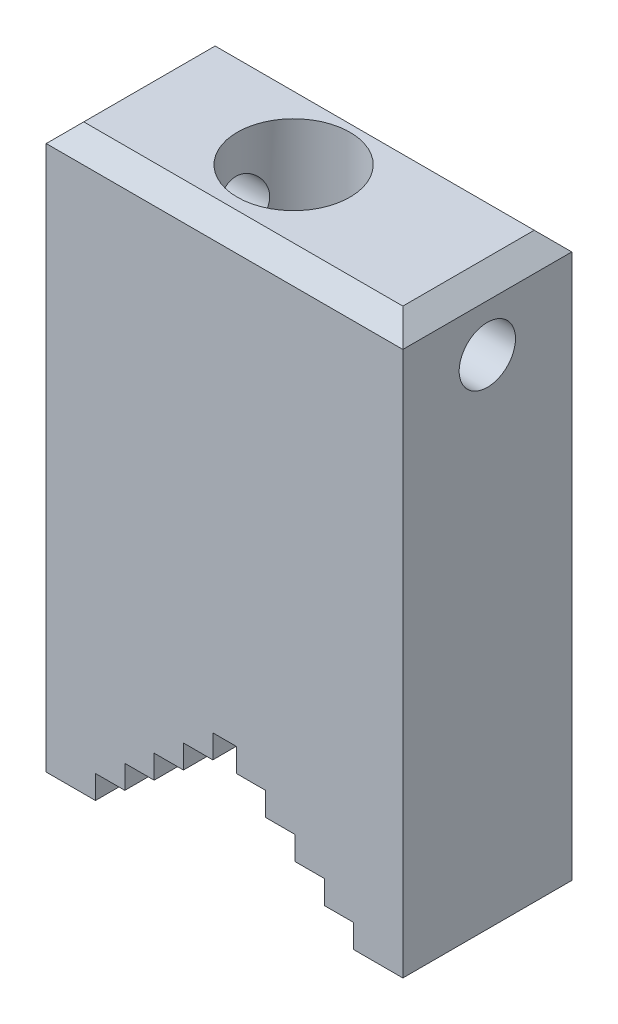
ISO-10303-21;
HEADER;
FILE_DESCRIPTION(('STEP AP214'),'2;1');
FILE_NAME('part.step','',(''),(''),'','','');
FILE_SCHEMA(('AUTOMOTIVE_DESIGN { 1 0 10303 214 1 1 1 1 }'));
ENDSEC;
DATA;
#1=APPLICATION_CONTEXT('core data for automotive mechanical design processes');
#2=APPLICATION_PROTOCOL_DEFINITION('international standard','automotive_design',2000,#1);
#3=PRODUCT_CONTEXT('',#1,'mechanical');
#4=PRODUCT('Part','Part','',(#3));
#5=PRODUCT_RELATED_PRODUCT_CATEGORY('part','',(#4));
#6=PRODUCT_DEFINITION_FORMATION('','',#4);
#7=PRODUCT_DEFINITION_CONTEXT('part definition',#1,'design');
#8=PRODUCT_DEFINITION('design','',#6,#7);
#9=PRODUCT_DEFINITION_SHAPE('','',#8);
#10=(LENGTH_UNIT() NAMED_UNIT(*) SI_UNIT(.MILLI.,.METRE.));
#11=(NAMED_UNIT(*) PLANE_ANGLE_UNIT() SI_UNIT($,.RADIAN.));
#12=(NAMED_UNIT(*) SI_UNIT($,.STERADIAN.) SOLID_ANGLE_UNIT());
#13=UNCERTAINTY_MEASURE_WITH_UNIT(LENGTH_MEASURE(1.E-05),#10,'distance_accuracy_value','');
#14=(GEOMETRIC_REPRESENTATION_CONTEXT(3) GLOBAL_UNCERTAINTY_ASSIGNED_CONTEXT((#13)) GLOBAL_UNIT_ASSIGNED_CONTEXT((#10,
#11,#12)) REPRESENTATION_CONTEXT('',''));
#15=CARTESIAN_POINT('',(0.,0.,0.));
#16=DIRECTION('',(0.,0.,1.));
#17=DIRECTION('',(1.,0.,0.));
#18=AXIS2_PLACEMENT_3D('',#15,#16,#17);
#19=CARTESIAN_POINT('',(-19.,0.,9.));
#20=DIRECTION('',(1.,0.,0.));
#21=DIRECTION('',(0.,0.,-1.));
#22=AXIS2_PLACEMENT_3D('',#19,#20,#21);
#23=PLANE('',#22);
#24=CARTESIAN_POINT('',(-19.,53.,0.));
#25=DIRECTION('',(1.,0.,0.));
#26=DIRECTION('',(0.,0.,-1.));
#27=AXIS2_PLACEMENT_3D('',#24,#25,#26);
#28=CIRCLE('',#27,3.);
#29=CARTESIAN_POINT('',(-19.,53.,-3.));
#30=VERTEX_POINT('',#29);
#31=EDGE_CURVE('E412',#30,#30,#28,.T.);
#32=ORIENTED_EDGE('',*,*,#31,.T.);
#33=EDGE_LOOP('',(#32));
#34=FACE_BOUND('',#33,.T.);
#35=DIRECTION('',(0.,-1.,0.));
#36=VECTOR('',#35,1.);
#37=CARTESIAN_POINT('',(-19.,0.,9.));
#38=LINE('',#37,#36);
#39=CARTESIAN_POINT('',(-19.,58.,9.));
#40=VERTEX_POINT('',#39);
#41=CARTESIAN_POINT('',(-19.,0.,9.));
#42=VERTEX_POINT('',#41);
#43=EDGE_CURVE('E229',#40,#42,#38,.T.);
#44=ORIENTED_EDGE('',*,*,#43,.F.);
#45=DIRECTION('',(0.,0.,-1.));
#46=VECTOR('',#45,1.);
#47=CARTESIAN_POINT('',(-19.,58.,9.));
#48=LINE('',#47,#46);
#49=CARTESIAN_POINT('',(-19.,58.,-9.));
#50=VERTEX_POINT('',#49);
#51=EDGE_CURVE('E400',#40,#50,#48,.T.);
#52=ORIENTED_EDGE('',*,*,#51,.T.);
#53=DIRECTION('',(0.,-1.,0.));
#54=VECTOR('',#53,1.);
#55=CARTESIAN_POINT('',(-19.,0.,-9.));
#56=LINE('',#55,#54);
#57=CARTESIAN_POINT('',(-19.,0.,-9.));
#58=VERTEX_POINT('',#57);
#59=EDGE_CURVE('E277',#50,#58,#56,.T.);
#60=ORIENTED_EDGE('',*,*,#59,.T.);
#61=DIRECTION('',(0.,0.,-1.));
#62=VECTOR('',#61,1.);
#63=CARTESIAN_POINT('',(-19.,0.,9.));
#64=LINE('',#63,#62);
#65=EDGE_CURVE('E385',#42,#58,#64,.T.);
#66=ORIENTED_EDGE('',*,*,#65,.F.);
#67=EDGE_LOOP('',(#44,#52,#60,#66));
#68=FACE_BOUND('',#67,.T.);
#69=ADVANCED_FACE('F31',(#34,#68),#23,.F.);
#70=CARTESIAN_POINT('',(-19.,0.,9.));
#71=DIRECTION('',(0.,1.,0.));
#72=DIRECTION('',(-1.,0.,0.));
#73=AXIS2_PLACEMENT_3D('',#70,#71,#72);
#74=PLANE('',#73);
#75=DIRECTION('',(1.,0.,0.));
#76=VECTOR('',#75,1.);
#77=CARTESIAN_POINT('',(-19.,0.,-9.));
#78=LINE('',#77,#76);
#79=CARTESIAN_POINT('',(-13.75,0.,-9.));
#80=VERTEX_POINT('',#79);
#81=EDGE_CURVE('E279',#58,#80,#78,.T.);
#82=ORIENTED_EDGE('',*,*,#81,.T.);
#83=DIRECTION('',(0.,0.,-1.));
#84=VECTOR('',#83,1.);
#85=CARTESIAN_POINT('',(-13.75,0.,9.));
#86=LINE('',#85,#84);
#87=CARTESIAN_POINT('',(-13.75,0.,9.));
#88=VERTEX_POINT('',#87);
#89=EDGE_CURVE('E382',#88,#80,#86,.T.);
#90=ORIENTED_EDGE('',*,*,#89,.F.);
#91=DIRECTION('',(1.,0.,0.));
#92=VECTOR('',#91,1.);
#93=CARTESIAN_POINT('',(-19.,0.,9.));
#94=LINE('',#93,#92);
#95=EDGE_CURVE('E231',#42,#88,#94,.T.);
#96=ORIENTED_EDGE('',*,*,#95,.F.);
#97=ORIENTED_EDGE('',*,*,#65,.T.);
#98=EDGE_LOOP('',(#82,#90,#96,#97));
#99=FACE_BOUND('',#98,.T.);
#100=ADVANCED_FACE('F427',(#99),#74,.F.);
#101=CARTESIAN_POINT('',(-13.75,0.,9.));
#102=DIRECTION('',(-1.,0.,0.));
#103=DIRECTION('',(0.,0.,1.));
#104=AXIS2_PLACEMENT_3D('',#101,#102,#103);
#105=PLANE('',#104);
#106=DIRECTION('',(0.,1.,0.));
#107=VECTOR('',#106,1.);
#108=CARTESIAN_POINT('',(-13.75,0.,-9.));
#109=LINE('',#108,#107);
#110=CARTESIAN_POINT('',(-13.75,2.5,-9.));
#111=VERTEX_POINT('',#110);
#112=EDGE_CURVE('E282',#80,#111,#109,.T.);
#113=ORIENTED_EDGE('',*,*,#112,.T.);
#114=DIRECTION('',(0.,0.,-1.));
#115=VECTOR('',#114,1.);
#116=CARTESIAN_POINT('',(-13.75,2.5,9.));
#117=LINE('',#116,#115);
#118=CARTESIAN_POINT('',(-13.75,2.5,9.));
#119=VERTEX_POINT('',#118);
#120=EDGE_CURVE('E379',#119,#111,#117,.T.);
#121=ORIENTED_EDGE('',*,*,#120,.F.);
#122=DIRECTION('',(0.,1.,0.));
#123=VECTOR('',#122,1.);
#124=CARTESIAN_POINT('',(-13.75,0.,9.));
#125=LINE('',#124,#123);
#126=EDGE_CURVE('E234',#88,#119,#125,.T.);
#127=ORIENTED_EDGE('',*,*,#126,.F.);
#128=ORIENTED_EDGE('',*,*,#89,.T.);
#129=EDGE_LOOP('',(#113,#121,#127,#128));
#130=FACE_BOUND('',#129,.T.);
#131=ADVANCED_FACE('F433',(#130),#105,.F.);
#132=CARTESIAN_POINT('',(-13.75,2.5,9.));
#133=DIRECTION('',(0.,1.,0.));
#134=DIRECTION('',(0.,0.,1.));
#135=AXIS2_PLACEMENT_3D('',#132,#133,#134);
#136=PLANE('',#135);
#137=DIRECTION('',(1.,0.,0.));
#138=VECTOR('',#137,1.);
#139=CARTESIAN_POINT('',(-13.75,2.5,-9.));
#140=LINE('',#139,#138);
#141=CARTESIAN_POINT('',(-10.625,2.5,-9.));
#142=VERTEX_POINT('',#141);
#143=EDGE_CURVE('E284',#111,#142,#140,.T.);
#144=ORIENTED_EDGE('',*,*,#143,.T.);
#145=DIRECTION('',(0.,0.,-1.));
#146=VECTOR('',#145,1.);
#147=CARTESIAN_POINT('',(-10.625,2.5,9.));
#148=LINE('',#147,#146);
#149=CARTESIAN_POINT('',(-10.625,2.5,9.));
#150=VERTEX_POINT('',#149);
#151=EDGE_CURVE('E376',#150,#142,#148,.T.);
#152=ORIENTED_EDGE('',*,*,#151,.F.);
#153=DIRECTION('',(1.,0.,0.));
#154=VECTOR('',#153,1.);
#155=CARTESIAN_POINT('',(-13.75,2.5,9.));
#156=LINE('',#155,#154);
#157=EDGE_CURVE('E236',#119,#150,#156,.T.);
#158=ORIENTED_EDGE('',*,*,#157,.F.);
#159=ORIENTED_EDGE('',*,*,#120,.T.);
#160=EDGE_LOOP('',(#144,#152,#158,#159));
#161=FACE_BOUND('',#160,.T.);
#162=ADVANCED_FACE('F558',(#161),#136,.F.);
#163=CARTESIAN_POINT('',(-10.625,2.5,9.));
#164=DIRECTION('',(-1.,0.,0.));
#165=DIRECTION('',(0.,0.,1.));
#166=AXIS2_PLACEMENT_3D('',#163,#164,#165);
#167=PLANE('',#166);
#168=DIRECTION('',(0.,1.,0.));
#169=VECTOR('',#168,1.);
#170=CARTESIAN_POINT('',(-10.625,2.5,-9.));
#171=LINE('',#170,#169);
#172=CARTESIAN_POINT('',(-10.625,5.,-9.));
#173=VERTEX_POINT('',#172);
#174=EDGE_CURVE('E286',#142,#173,#171,.T.);
#175=ORIENTED_EDGE('',*,*,#174,.T.);
#176=DIRECTION('',(0.,0.,-1.));
#177=VECTOR('',#176,1.);
#178=CARTESIAN_POINT('',(-10.625,5.,9.));
#179=LINE('',#178,#177);
#180=CARTESIAN_POINT('',(-10.625,5.,9.));
#181=VERTEX_POINT('',#180);
#182=EDGE_CURVE('E373',#181,#173,#179,.T.);
#183=ORIENTED_EDGE('',*,*,#182,.F.);
#184=DIRECTION('',(0.,1.,0.));
#185=VECTOR('',#184,1.);
#186=CARTESIAN_POINT('',(-10.625,2.5,9.));
#187=LINE('',#186,#185);
#188=EDGE_CURVE('E238',#150,#181,#187,.T.);
#189=ORIENTED_EDGE('',*,*,#188,.F.);
#190=ORIENTED_EDGE('',*,*,#151,.T.);
#191=EDGE_LOOP('',(#175,#183,#189,#190));
#192=FACE_BOUND('',#191,.T.);
#193=ADVANCED_FACE('F554',(#192),#167,.F.);
#194=CARTESIAN_POINT('',(-10.625,5.,9.));
#195=DIRECTION('',(0.,1.,0.));
#196=DIRECTION('',(0.,0.,1.));
#197=AXIS2_PLACEMENT_3D('',#194,#195,#196);
#198=PLANE('',#197);
#199=DIRECTION('',(1.,0.,0.));
#200=VECTOR('',#199,1.);
#201=CARTESIAN_POINT('',(-10.625,5.,-9.));
#202=LINE('',#201,#200);
#203=CARTESIAN_POINT('',(-7.5,5.,-9.));
#204=VERTEX_POINT('',#203);
#205=EDGE_CURVE('E288',#173,#204,#202,.T.);
#206=ORIENTED_EDGE('',*,*,#205,.T.);
#207=DIRECTION('',(0.,0.,-1.));
#208=VECTOR('',#207,1.);
#209=CARTESIAN_POINT('',(-7.5,5.,9.));
#210=LINE('',#209,#208);
#211=CARTESIAN_POINT('',(-7.5,5.,9.));
#212=VERTEX_POINT('',#211);
#213=EDGE_CURVE('E370',#212,#204,#210,.T.);
#214=ORIENTED_EDGE('',*,*,#213,.F.);
#215=DIRECTION('',(1.,0.,0.));
#216=VECTOR('',#215,1.);
#217=CARTESIAN_POINT('',(-10.625,5.,9.));
#218=LINE('',#217,#216);
#219=EDGE_CURVE('E240',#181,#212,#218,.T.);
#220=ORIENTED_EDGE('',*,*,#219,.F.);
#221=ORIENTED_EDGE('',*,*,#182,.T.);
#222=EDGE_LOOP('',(#206,#214,#220,#221));
#223=FACE_BOUND('',#222,.T.);
#224=ADVANCED_FACE('F550',(#223),#198,.F.);
#225=CARTESIAN_POINT('',(-7.5,5.,9.));
#226=DIRECTION('',(-1.,0.,0.));
#227=DIRECTION('',(0.,0.,1.));
#228=AXIS2_PLACEMENT_3D('',#225,#226,#227);
#229=PLANE('',#228);
#230=DIRECTION('',(0.,1.,0.));
#231=VECTOR('',#230,1.);
#232=CARTESIAN_POINT('',(-7.5,5.,-9.));
#233=LINE('',#232,#231);
#234=CARTESIAN_POINT('',(-7.5,7.5,-9.));
#235=VERTEX_POINT('',#234);
#236=EDGE_CURVE('E290',#204,#235,#233,.T.);
#237=ORIENTED_EDGE('',*,*,#236,.T.);
#238=DIRECTION('',(0.,0.,-1.));
#239=VECTOR('',#238,1.);
#240=CARTESIAN_POINT('',(-7.5,7.5,9.));
#241=LINE('',#240,#239);
#242=CARTESIAN_POINT('',(-7.5,7.5,9.));
#243=VERTEX_POINT('',#242);
#244=EDGE_CURVE('E367',#243,#235,#241,.T.);
#245=ORIENTED_EDGE('',*,*,#244,.F.);
#246=DIRECTION('',(0.,1.,0.));
#247=VECTOR('',#246,1.);
#248=CARTESIAN_POINT('',(-7.5,5.,9.));
#249=LINE('',#248,#247);
#250=EDGE_CURVE('E242',#212,#243,#249,.T.);
#251=ORIENTED_EDGE('',*,*,#250,.F.);
#252=ORIENTED_EDGE('',*,*,#213,.T.);
#253=EDGE_LOOP('',(#237,#245,#251,#252));
#254=FACE_BOUND('',#253,.T.);
#255=ADVANCED_FACE('F546',(#254),#229,.F.);
#256=CARTESIAN_POINT('',(-7.5,7.5,9.));
#257=DIRECTION('',(0.,1.,0.));
#258=DIRECTION('',(0.,0.,1.));
#259=AXIS2_PLACEMENT_3D('',#256,#257,#258);
#260=PLANE('',#259);
#261=DIRECTION('',(1.,0.,0.));
#262=VECTOR('',#261,1.);
#263=CARTESIAN_POINT('',(-7.5,7.5,-9.));
#264=LINE('',#263,#262);
#265=CARTESIAN_POINT('',(-4.375,7.5,-9.));
#266=VERTEX_POINT('',#265);
#267=EDGE_CURVE('E292',#235,#266,#264,.T.);
#268=ORIENTED_EDGE('',*,*,#267,.T.);
#269=DIRECTION('',(0.,0.,-1.));
#270=VECTOR('',#269,1.);
#271=CARTESIAN_POINT('',(-4.375,7.5,9.));
#272=LINE('',#271,#270);
#273=CARTESIAN_POINT('',(-4.375,7.5,9.));
#274=VERTEX_POINT('',#273);
#275=EDGE_CURVE('E364',#274,#266,#272,.T.);
#276=ORIENTED_EDGE('',*,*,#275,.F.);
#277=DIRECTION('',(1.,0.,0.));
#278=VECTOR('',#277,1.);
#279=CARTESIAN_POINT('',(-7.5,7.5,9.));
#280=LINE('',#279,#278);
#281=EDGE_CURVE('E244',#243,#274,#280,.T.);
#282=ORIENTED_EDGE('',*,*,#281,.F.);
#283=ORIENTED_EDGE('',*,*,#244,.T.);
#284=EDGE_LOOP('',(#268,#276,#282,#283));
#285=FACE_BOUND('',#284,.T.);
#286=ADVANCED_FACE('F542',(#285),#260,.F.);
#287=CARTESIAN_POINT('',(-4.375,7.5,9.));
#288=DIRECTION('',(-1.,0.,0.));
#289=DIRECTION('',(0.,0.,1.));
#290=AXIS2_PLACEMENT_3D('',#287,#288,#289);
#291=PLANE('',#290);
#292=DIRECTION('',(0.,1.,0.));
#293=VECTOR('',#292,1.);
#294=CARTESIAN_POINT('',(-4.375,7.5,-9.));
#295=LINE('',#294,#293);
#296=CARTESIAN_POINT('',(-4.375,10.,-9.));
#297=VERTEX_POINT('',#296);
#298=EDGE_CURVE('E294',#266,#297,#295,.T.);
#299=ORIENTED_EDGE('',*,*,#298,.T.);
#300=DIRECTION('',(0.,0.,-1.));
#301=VECTOR('',#300,1.);
#302=CARTESIAN_POINT('',(-4.375,10.,9.));
#303=LINE('',#302,#301);
#304=CARTESIAN_POINT('',(-4.375,10.,9.));
#305=VERTEX_POINT('',#304);
#306=EDGE_CURVE('E361',#305,#297,#303,.T.);
#307=ORIENTED_EDGE('',*,*,#306,.F.);
#308=DIRECTION('',(0.,1.,0.));
#309=VECTOR('',#308,1.);
#310=CARTESIAN_POINT('',(-4.375,7.5,9.));
#311=LINE('',#310,#309);
#312=EDGE_CURVE('E246',#274,#305,#311,.T.);
#313=ORIENTED_EDGE('',*,*,#312,.F.);
#314=ORIENTED_EDGE('',*,*,#275,.T.);
#315=EDGE_LOOP('',(#299,#307,#313,#314));
#316=FACE_BOUND('',#315,.T.);
#317=ADVANCED_FACE('F538',(#316),#291,.F.);
#318=CARTESIAN_POINT('',(-4.375,10.,9.));
#319=DIRECTION('',(0.,1.,0.));
#320=DIRECTION('',(0.,0.,1.));
#321=AXIS2_PLACEMENT_3D('',#318,#319,#320);
#322=PLANE('',#321);
#323=DIRECTION('',(1.,0.,0.));
#324=VECTOR('',#323,1.);
#325=CARTESIAN_POINT('',(-4.375,10.,-9.));
#326=LINE('',#325,#324);
#327=CARTESIAN_POINT('',(-1.25,10.,-9.));
#328=VERTEX_POINT('',#327);
#329=EDGE_CURVE('E296',#297,#328,#326,.T.);
#330=ORIENTED_EDGE('',*,*,#329,.T.);
#331=DIRECTION('',(0.,0.,-1.));
#332=VECTOR('',#331,1.);
#333=CARTESIAN_POINT('',(-1.25,10.,9.));
#334=LINE('',#333,#332);
#335=CARTESIAN_POINT('',(-1.25,10.,9.));
#336=VERTEX_POINT('',#335);
#337=EDGE_CURVE('E358',#336,#328,#334,.T.);
#338=ORIENTED_EDGE('',*,*,#337,.F.);
#339=DIRECTION('',(1.,0.,0.));
#340=VECTOR('',#339,1.);
#341=CARTESIAN_POINT('',(-4.375,10.,9.));
#342=LINE('',#341,#340);
#343=EDGE_CURVE('E248',#305,#336,#342,.T.);
#344=ORIENTED_EDGE('',*,*,#343,.F.);
#345=ORIENTED_EDGE('',*,*,#306,.T.);
#346=EDGE_LOOP('',(#330,#338,#344,#345));
#347=FACE_BOUND('',#346,.T.);
#348=ADVANCED_FACE('F534',(#347),#322,.F.);
#349=CARTESIAN_POINT('',(-1.25,10.,9.));
#350=DIRECTION('',(-1.,0.,0.));
#351=DIRECTION('',(0.,0.,1.));
#352=AXIS2_PLACEMENT_3D('',#349,#350,#351);
#353=PLANE('',#352);
#354=DIRECTION('',(0.,1.,0.));
#355=VECTOR('',#354,1.);
#356=CARTESIAN_POINT('',(-1.25,10.,-9.));
#357=LINE('',#356,#355);
#358=CARTESIAN_POINT('',(-1.25,12.5,-9.));
#359=VERTEX_POINT('',#358);
#360=EDGE_CURVE('E298',#328,#359,#357,.T.);
#361=ORIENTED_EDGE('',*,*,#360,.T.);
#362=DIRECTION('',(0.,0.,-1.));
#363=VECTOR('',#362,1.);
#364=CARTESIAN_POINT('',(-1.25,12.5,9.));
#365=LINE('',#364,#363);
#366=CARTESIAN_POINT('',(-1.25,12.5,9.));
#367=VERTEX_POINT('',#366);
#368=EDGE_CURVE('E355',#367,#359,#365,.T.);
#369=ORIENTED_EDGE('',*,*,#368,.F.);
#370=DIRECTION('',(0.,1.,0.));
#371=VECTOR('',#370,1.);
#372=CARTESIAN_POINT('',(-1.25,10.,9.));
#373=LINE('',#372,#371);
#374=EDGE_CURVE('E250',#336,#367,#373,.T.);
#375=ORIENTED_EDGE('',*,*,#374,.F.);
#376=ORIENTED_EDGE('',*,*,#337,.T.);
#377=EDGE_LOOP('',(#361,#369,#375,#376));
#378=FACE_BOUND('',#377,.T.);
#379=ADVANCED_FACE('F530',(#378),#353,.F.);
#380=CARTESIAN_POINT('',(-1.25,12.5,9.));
#381=DIRECTION('',(0.,1.,0.));
#382=DIRECTION('',(0.,0.,1.));
#383=AXIS2_PLACEMENT_3D('',#380,#381,#382);
#384=PLANE('',#383);
#385=DIRECTION('',(1.,0.,0.));
#386=VECTOR('',#385,1.);
#387=CARTESIAN_POINT('',(-1.25,12.5,-9.));
#388=LINE('',#387,#386);
#389=CARTESIAN_POINT('',(1.25,12.5,-9.));
#390=VERTEX_POINT('',#389);
#391=EDGE_CURVE('E300',#359,#390,#388,.T.);
#392=ORIENTED_EDGE('',*,*,#391,.T.);
#393=DIRECTION('',(0.,0.,-1.));
#394=VECTOR('',#393,1.);
#395=CARTESIAN_POINT('',(1.25,12.5,9.));
#396=LINE('',#395,#394);
#397=CARTESIAN_POINT('',(1.25,12.5,9.));
#398=VERTEX_POINT('',#397);
#399=EDGE_CURVE('E352',#398,#390,#396,.T.);
#400=ORIENTED_EDGE('',*,*,#399,.F.);
#401=DIRECTION('',(1.,0.,0.));
#402=VECTOR('',#401,1.);
#403=CARTESIAN_POINT('',(-1.25,12.5,9.));
#404=LINE('',#403,#402);
#405=EDGE_CURVE('E252',#367,#398,#404,.T.);
#406=ORIENTED_EDGE('',*,*,#405,.F.);
#407=ORIENTED_EDGE('',*,*,#368,.T.);
#408=EDGE_LOOP('',(#392,#400,#406,#407));
#409=FACE_BOUND('',#408,.T.);
#410=ADVANCED_FACE('F526',(#409),#384,.F.);
#411=CARTESIAN_POINT('',(1.25,10.,9.));
#412=DIRECTION('',(1.,0.,0.));
#413=DIRECTION('',(0.,0.,-1.));
#414=AXIS2_PLACEMENT_3D('',#411,#412,#413);
#415=PLANE('',#414);
#416=DIRECTION('',(0.,-1.,0.));
#417=VECTOR('',#416,1.);
#418=CARTESIAN_POINT('',(1.25,10.,-9.));
#419=LINE('',#418,#417);
#420=CARTESIAN_POINT('',(1.25,10.,-9.));
#421=VERTEX_POINT('',#420);
#422=EDGE_CURVE('E302',#390,#421,#419,.T.);
#423=ORIENTED_EDGE('',*,*,#422,.T.);
#424=DIRECTION('',(0.,0.,-1.));
#425=VECTOR('',#424,1.);
#426=CARTESIAN_POINT('',(1.25,10.,9.));
#427=LINE('',#426,#425);
#428=CARTESIAN_POINT('',(1.25,10.,9.));
#429=VERTEX_POINT('',#428);
#430=EDGE_CURVE('E349',#429,#421,#427,.T.);
#431=ORIENTED_EDGE('',*,*,#430,.F.);
#432=DIRECTION('',(0.,-1.,0.));
#433=VECTOR('',#432,1.);
#434=CARTESIAN_POINT('',(1.25,10.,9.));
#435=LINE('',#434,#433);
#436=EDGE_CURVE('E254',#398,#429,#435,.T.);
#437=ORIENTED_EDGE('',*,*,#436,.F.);
#438=ORIENTED_EDGE('',*,*,#399,.T.);
#439=EDGE_LOOP('',(#423,#431,#437,#438));
#440=FACE_BOUND('',#439,.T.);
#441=ADVANCED_FACE('F522',(#440),#415,.F.);
#442=CARTESIAN_POINT('',(4.375,10.,9.));
#443=DIRECTION('',(0.,1.,0.));
#444=DIRECTION('',(0.,0.,1.));
#445=AXIS2_PLACEMENT_3D('',#442,#443,#444);
#446=PLANE('',#445);
#447=DIRECTION('',(1.,0.,0.));
#448=VECTOR('',#447,1.);
#449=CARTESIAN_POINT('',(4.375,10.,-9.));
#450=LINE('',#449,#448);
#451=CARTESIAN_POINT('',(4.375,10.,-9.));
#452=VERTEX_POINT('',#451);
#453=EDGE_CURVE('E304',#421,#452,#450,.T.);
#454=ORIENTED_EDGE('',*,*,#453,.T.);
#455=DIRECTION('',(0.,0.,-1.));
#456=VECTOR('',#455,1.);
#457=CARTESIAN_POINT('',(4.375,10.,9.));
#458=LINE('',#457,#456);
#459=CARTESIAN_POINT('',(4.375,10.,9.));
#460=VERTEX_POINT('',#459);
#461=EDGE_CURVE('E346',#460,#452,#458,.T.);
#462=ORIENTED_EDGE('',*,*,#461,.F.);
#463=DIRECTION('',(1.,0.,0.));
#464=VECTOR('',#463,1.);
#465=CARTESIAN_POINT('',(4.375,10.,9.));
#466=LINE('',#465,#464);
#467=EDGE_CURVE('E256',#429,#460,#466,.T.);
#468=ORIENTED_EDGE('',*,*,#467,.F.);
#469=ORIENTED_EDGE('',*,*,#430,.T.);
#470=EDGE_LOOP('',(#454,#462,#468,#469));
#471=FACE_BOUND('',#470,.T.);
#472=ADVANCED_FACE('F518',(#471),#446,.F.);
#473=CARTESIAN_POINT('',(4.375,7.5,9.));
#474=DIRECTION('',(1.,0.,0.));
#475=DIRECTION('',(0.,0.,-1.));
#476=AXIS2_PLACEMENT_3D('',#473,#474,#475);
#477=PLANE('',#476);
#478=DIRECTION('',(0.,-1.,0.));
#479=VECTOR('',#478,1.);
#480=CARTESIAN_POINT('',(4.375,7.5,-9.));
#481=LINE('',#480,#479);
#482=CARTESIAN_POINT('',(4.375,7.5,-9.));
#483=VERTEX_POINT('',#482);
#484=EDGE_CURVE('E306',#452,#483,#481,.T.);
#485=ORIENTED_EDGE('',*,*,#484,.T.);
#486=DIRECTION('',(0.,0.,-1.));
#487=VECTOR('',#486,1.);
#488=CARTESIAN_POINT('',(4.375,7.5,9.));
#489=LINE('',#488,#487);
#490=CARTESIAN_POINT('',(4.375,7.5,9.));
#491=VERTEX_POINT('',#490);
#492=EDGE_CURVE('E343',#491,#483,#489,.T.);
#493=ORIENTED_EDGE('',*,*,#492,.F.);
#494=DIRECTION('',(0.,-1.,0.));
#495=VECTOR('',#494,1.);
#496=CARTESIAN_POINT('',(4.375,7.5,9.));
#497=LINE('',#496,#495);
#498=EDGE_CURVE('E258',#460,#491,#497,.T.);
#499=ORIENTED_EDGE('',*,*,#498,.F.);
#500=ORIENTED_EDGE('',*,*,#461,.T.);
#501=EDGE_LOOP('',(#485,#493,#499,#500));
#502=FACE_BOUND('',#501,.T.);
#503=ADVANCED_FACE('F514',(#502),#477,.F.);
#504=CARTESIAN_POINT('',(7.5,7.5,9.));
#505=DIRECTION('',(0.,1.,0.));
#506=DIRECTION('',(0.,0.,1.));
#507=AXIS2_PLACEMENT_3D('',#504,#505,#506);
#508=PLANE('',#507);
#509=DIRECTION('',(1.,0.,0.));
#510=VECTOR('',#509,1.);
#511=CARTESIAN_POINT('',(7.5,7.5,-9.));
#512=LINE('',#511,#510);
#513=CARTESIAN_POINT('',(7.5,7.5,-9.));
#514=VERTEX_POINT('',#513);
#515=EDGE_CURVE('E308',#483,#514,#512,.T.);
#516=ORIENTED_EDGE('',*,*,#515,.T.);
#517=DIRECTION('',(0.,0.,-1.));
#518=VECTOR('',#517,1.);
#519=CARTESIAN_POINT('',(7.5,7.5,9.));
#520=LINE('',#519,#518);
#521=CARTESIAN_POINT('',(7.5,7.5,9.));
#522=VERTEX_POINT('',#521);
#523=EDGE_CURVE('E340',#522,#514,#520,.T.);
#524=ORIENTED_EDGE('',*,*,#523,.F.);
#525=DIRECTION('',(1.,0.,0.));
#526=VECTOR('',#525,1.);
#527=CARTESIAN_POINT('',(7.5,7.5,9.));
#528=LINE('',#527,#526);
#529=EDGE_CURVE('E260',#491,#522,#528,.T.);
#530=ORIENTED_EDGE('',*,*,#529,.F.);
#531=ORIENTED_EDGE('',*,*,#492,.T.);
#532=EDGE_LOOP('',(#516,#524,#530,#531));
#533=FACE_BOUND('',#532,.T.);
#534=ADVANCED_FACE('F510',(#533),#508,.F.);
#535=CARTESIAN_POINT('',(7.5,5.,9.));
#536=DIRECTION('',(1.,0.,0.));
#537=DIRECTION('',(0.,0.,-1.));
#538=AXIS2_PLACEMENT_3D('',#535,#536,#537);
#539=PLANE('',#538);
#540=DIRECTION('',(0.,-1.,0.));
#541=VECTOR('',#540,1.);
#542=CARTESIAN_POINT('',(7.5,5.,-9.));
#543=LINE('',#542,#541);
#544=CARTESIAN_POINT('',(7.5,5.,-9.));
#545=VERTEX_POINT('',#544);
#546=EDGE_CURVE('E310',#514,#545,#543,.T.);
#547=ORIENTED_EDGE('',*,*,#546,.T.);
#548=DIRECTION('',(0.,0.,-1.));
#549=VECTOR('',#548,1.);
#550=CARTESIAN_POINT('',(7.5,5.,9.));
#551=LINE('',#550,#549);
#552=CARTESIAN_POINT('',(7.5,5.,9.));
#553=VERTEX_POINT('',#552);
#554=EDGE_CURVE('E337',#553,#545,#551,.T.);
#555=ORIENTED_EDGE('',*,*,#554,.F.);
#556=DIRECTION('',(0.,-1.,0.));
#557=VECTOR('',#556,1.);
#558=CARTESIAN_POINT('',(7.5,5.,9.));
#559=LINE('',#558,#557);
#560=EDGE_CURVE('E262',#522,#553,#559,.T.);
#561=ORIENTED_EDGE('',*,*,#560,.F.);
#562=ORIENTED_EDGE('',*,*,#523,.T.);
#563=EDGE_LOOP('',(#547,#555,#561,#562));
#564=FACE_BOUND('',#563,.T.);
#565=ADVANCED_FACE('F506',(#564),#539,.F.);
#566=CARTESIAN_POINT('',(10.625,5.,9.));
#567=DIRECTION('',(0.,1.,0.));
#568=DIRECTION('',(0.,0.,1.));
#569=AXIS2_PLACEMENT_3D('',#566,#567,#568);
#570=PLANE('',#569);
#571=DIRECTION('',(1.,0.,0.));
#572=VECTOR('',#571,1.);
#573=CARTESIAN_POINT('',(10.625,5.,-9.));
#574=LINE('',#573,#572);
#575=CARTESIAN_POINT('',(10.625,5.,-9.));
#576=VERTEX_POINT('',#575);
#577=EDGE_CURVE('E312',#545,#576,#574,.T.);
#578=ORIENTED_EDGE('',*,*,#577,.T.);
#579=DIRECTION('',(0.,0.,-1.));
#580=VECTOR('',#579,1.);
#581=CARTESIAN_POINT('',(10.625,5.,9.));
#582=LINE('',#581,#580);
#583=CARTESIAN_POINT('',(10.625,5.,9.));
#584=VERTEX_POINT('',#583);
#585=EDGE_CURVE('E334',#584,#576,#582,.T.);
#586=ORIENTED_EDGE('',*,*,#585,.F.);
#587=DIRECTION('',(1.,0.,0.));
#588=VECTOR('',#587,1.);
#589=CARTESIAN_POINT('',(10.625,5.,9.));
#590=LINE('',#589,#588);
#591=EDGE_CURVE('E264',#553,#584,#590,.T.);
#592=ORIENTED_EDGE('',*,*,#591,.F.);
#593=ORIENTED_EDGE('',*,*,#554,.T.);
#594=EDGE_LOOP('',(#578,#586,#592,#593));
#595=FACE_BOUND('',#594,.T.);
#596=ADVANCED_FACE('F502',(#595),#570,.F.);
#597=CARTESIAN_POINT('',(10.625,2.5,9.));
#598=DIRECTION('',(1.,0.,0.));
#599=DIRECTION('',(0.,0.,-1.));
#600=AXIS2_PLACEMENT_3D('',#597,#598,#599);
#601=PLANE('',#600);
#602=DIRECTION('',(0.,-1.,0.));
#603=VECTOR('',#602,1.);
#604=CARTESIAN_POINT('',(10.625,2.5,-9.));
#605=LINE('',#604,#603);
#606=CARTESIAN_POINT('',(10.625,2.5,-9.));
#607=VERTEX_POINT('',#606);
#608=EDGE_CURVE('E314',#576,#607,#605,.T.);
#609=ORIENTED_EDGE('',*,*,#608,.T.);
#610=DIRECTION('',(0.,0.,-1.));
#611=VECTOR('',#610,1.);
#612=CARTESIAN_POINT('',(10.625,2.5,9.));
#613=LINE('',#612,#611);
#614=CARTESIAN_POINT('',(10.625,2.5,9.));
#615=VERTEX_POINT('',#614);
#616=EDGE_CURVE('E331',#615,#607,#613,.T.);
#617=ORIENTED_EDGE('',*,*,#616,.F.);
#618=DIRECTION('',(0.,-1.,0.));
#619=VECTOR('',#618,1.);
#620=CARTESIAN_POINT('',(10.625,2.5,9.));
#621=LINE('',#620,#619);
#622=EDGE_CURVE('E266',#584,#615,#621,.T.);
#623=ORIENTED_EDGE('',*,*,#622,.F.);
#624=ORIENTED_EDGE('',*,*,#585,.T.);
#625=EDGE_LOOP('',(#609,#617,#623,#624));
#626=FACE_BOUND('',#625,.T.);
#627=ADVANCED_FACE('F498',(#626),#601,.F.);
#628=CARTESIAN_POINT('',(13.75,2.5,9.));
#629=DIRECTION('',(0.,1.,0.));
#630=DIRECTION('',(0.,0.,1.));
#631=AXIS2_PLACEMENT_3D('',#628,#629,#630);
#632=PLANE('',#631);
#633=DIRECTION('',(1.,0.,0.));
#634=VECTOR('',#633,1.);
#635=CARTESIAN_POINT('',(13.75,2.5,-9.));
#636=LINE('',#635,#634);
#637=CARTESIAN_POINT('',(13.75,2.5,-9.));
#638=VERTEX_POINT('',#637);
#639=EDGE_CURVE('E316',#607,#638,#636,.T.);
#640=ORIENTED_EDGE('',*,*,#639,.T.);
#641=DIRECTION('',(0.,0.,-1.));
#642=VECTOR('',#641,1.);
#643=CARTESIAN_POINT('',(13.75,2.5,9.));
#644=LINE('',#643,#642);
#645=CARTESIAN_POINT('',(13.75,2.5,9.));
#646=VERTEX_POINT('',#645);
#647=EDGE_CURVE('E328',#646,#638,#644,.T.);
#648=ORIENTED_EDGE('',*,*,#647,.F.);
#649=DIRECTION('',(1.,0.,0.));
#650=VECTOR('',#649,1.);
#651=CARTESIAN_POINT('',(13.75,2.5,9.));
#652=LINE('',#651,#650);
#653=EDGE_CURVE('E268',#615,#646,#652,.T.);
#654=ORIENTED_EDGE('',*,*,#653,.F.);
#655=ORIENTED_EDGE('',*,*,#616,.T.);
#656=EDGE_LOOP('',(#640,#648,#654,#655));
#657=FACE_BOUND('',#656,.T.);
#658=ADVANCED_FACE('F494',(#657),#632,.F.);
#659=CARTESIAN_POINT('',(13.75,0.,9.));
#660=DIRECTION('',(1.,0.,0.));
#661=DIRECTION('',(0.,0.,-1.));
#662=AXIS2_PLACEMENT_3D('',#659,#660,#661);
#663=PLANE('',#662);
#664=DIRECTION('',(0.,-1.,0.));
#665=VECTOR('',#664,1.);
#666=CARTESIAN_POINT('',(13.75,0.,-9.));
#667=LINE('',#666,#665);
#668=CARTESIAN_POINT('',(13.75,0.,-9.));
#669=VERTEX_POINT('',#668);
#670=EDGE_CURVE('E318',#638,#669,#667,.T.);
#671=ORIENTED_EDGE('',*,*,#670,.T.);
#672=DIRECTION('',(0.,0.,-1.));
#673=VECTOR('',#672,1.);
#674=CARTESIAN_POINT('',(13.75,0.,9.));
#675=LINE('',#674,#673);
#676=CARTESIAN_POINT('',(13.75,0.,9.));
#677=VERTEX_POINT('',#676);
#678=EDGE_CURVE('E325',#677,#669,#675,.T.);
#679=ORIENTED_EDGE('',*,*,#678,.F.);
#680=DIRECTION('',(0.,-1.,0.));
#681=VECTOR('',#680,1.);
#682=CARTESIAN_POINT('',(13.75,0.,9.));
#683=LINE('',#682,#681);
#684=EDGE_CURVE('E270',#646,#677,#683,.T.);
#685=ORIENTED_EDGE('',*,*,#684,.F.);
#686=ORIENTED_EDGE('',*,*,#647,.T.);
#687=EDGE_LOOP('',(#671,#679,#685,#686));
#688=FACE_BOUND('',#687,.T.);
#689=ADVANCED_FACE('F490',(#688),#663,.F.);
#690=CARTESIAN_POINT('',(19.,0.,9.));
#691=DIRECTION('',(0.,1.,0.));
#692=DIRECTION('',(-1.,0.,0.));
#693=AXIS2_PLACEMENT_3D('',#690,#691,#692);
#694=PLANE('',#693);
#695=DIRECTION('',(1.,0.,0.));
#696=VECTOR('',#695,1.);
#697=CARTESIAN_POINT('',(19.,0.,-9.));
#698=LINE('',#697,#696);
#699=CARTESIAN_POINT('',(19.,0.,-9.));
#700=VERTEX_POINT('',#699);
#701=EDGE_CURVE('E320',#669,#700,#698,.T.);
#702=ORIENTED_EDGE('',*,*,#701,.T.);
#703=DIRECTION('',(0.,0.,-1.));
#704=VECTOR('',#703,1.);
#705=CARTESIAN_POINT('',(19.,0.,9.));
#706=LINE('',#705,#704);
#707=CARTESIAN_POINT('',(19.,0.,9.));
#708=VERTEX_POINT('',#707);
#709=EDGE_CURVE('E276',#708,#700,#706,.T.);
#710=ORIENTED_EDGE('',*,*,#709,.F.);
#711=DIRECTION('',(1.,0.,0.));
#712=VECTOR('',#711,1.);
#713=CARTESIAN_POINT('',(19.,0.,9.));
#714=LINE('',#713,#712);
#715=EDGE_CURVE('E272',#677,#708,#714,.T.);
#716=ORIENTED_EDGE('',*,*,#715,.F.);
#717=ORIENTED_EDGE('',*,*,#678,.T.);
#718=EDGE_LOOP('',(#702,#710,#716,#717));
#719=FACE_BOUND('',#718,.T.);
#720=ADVANCED_FACE('F482',(#719),#694,.F.);
#721=CARTESIAN_POINT('',(19.,0.,9.));
#722=DIRECTION('',(-1.,0.,0.));
#723=DIRECTION('',(0.,0.,1.));
#724=AXIS2_PLACEMENT_3D('',#721,#722,#723);
#725=PLANE('',#724);
#726=CARTESIAN_POINT('',(19.,53.,0.));
#727=DIRECTION('',(1.,0.,0.));
#728=DIRECTION('',(0.,0.,-1.));
#729=AXIS2_PLACEMENT_3D('',#726,#727,#728);
#730=CIRCLE('',#729,3.);
#731=CARTESIAN_POINT('',(19.,53.,-3.));
#732=VERTEX_POINT('',#731);
#733=EDGE_CURVE('E832',#732,#732,#730,.T.);
#734=ORIENTED_EDGE('',*,*,#733,.F.);
#735=EDGE_LOOP('',(#734));
#736=FACE_BOUND('',#735,.T.);
#737=DIRECTION('',(0.,1.,0.));
#738=VECTOR('',#737,1.);
#739=CARTESIAN_POINT('',(19.,0.,-9.));
#740=LINE('',#739,#738);
#741=CARTESIAN_POINT('',(19.,58.,-9.));
#742=VERTEX_POINT('',#741);
#743=EDGE_CURVE('E232',#700,#742,#740,.T.);
#744=ORIENTED_EDGE('',*,*,#743,.T.);
#745=DIRECTION('',(0.,0.,1.));
#746=VECTOR('',#745,1.);
#747=CARTESIAN_POINT('',(19.,58.,9.));
#748=LINE('',#747,#746);
#749=CARTESIAN_POINT('',(19.,58.,9.));
#750=VERTEX_POINT('',#749);
#751=EDGE_CURVE('E11',#742,#750,#748,.T.);
#752=ORIENTED_EDGE('',*,*,#751,.T.);
#753=DIRECTION('',(0.,1.,0.));
#754=VECTOR('',#753,1.);
#755=CARTESIAN_POINT('',(19.,0.,9.));
#756=LINE('',#755,#754);
#757=EDGE_CURVE('E274',#708,#750,#756,.T.);
#758=ORIENTED_EDGE('',*,*,#757,.F.);
#759=ORIENTED_EDGE('',*,*,#709,.T.);
#760=EDGE_LOOP('',(#744,#752,#758,#759));
#761=FACE_BOUND('',#760,.T.);
#762=ADVANCED_FACE('F474',(#736,#761),#725,.F.);
#763=CARTESIAN_POINT('',(-19.,60.,9.));
#764=DIRECTION('',(0.,-1.,0.));
#765=DIRECTION('',(0.,0.,-1.));
#766=AXIS2_PLACEMENT_3D('',#763,#764,#765);
#767=PLANE('',#766);
#768=CARTESIAN_POINT('',(-1.86633430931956,60.,-0.225035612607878));
#769=DIRECTION('',(0.,1.,0.));
#770=DIRECTION('',(0.,0.,1.));
#771=AXIS2_PLACEMENT_3D('',#768,#769,#770);
#772=CIRCLE('',#771,6.);
#773=CARTESIAN_POINT('',(-1.86633430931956,60.,5.77496438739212));
#774=VERTEX_POINT('',#773);
#775=EDGE_CURVE('E221',#774,#774,#772,.T.);
#776=ORIENTED_EDGE('',*,*,#775,.F.);
#777=EDGE_LOOP('',(#776));
#778=FACE_BOUND('',#777,.T.);
#779=DIRECTION('',(0.,0.,-1.));
#780=VECTOR('',#779,1.);
#781=CARTESIAN_POINT('',(17.,60.,9.));
#782=LINE('',#781,#780);
#783=CARTESIAN_POINT('',(17.,60.,7.));
#784=VERTEX_POINT('',#783);
#785=CARTESIAN_POINT('',(17.,60.,-7.));
#786=VERTEX_POINT('',#785);
#787=EDGE_CURVE('E388',#784,#786,#782,.T.);
#788=ORIENTED_EDGE('',*,*,#787,.T.);
#789=DIRECTION('',(-1.,0.,0.));
#790=VECTOR('',#789,1.);
#791=CARTESIAN_POINT('',(-19.,60.,-7.));
#792=LINE('',#791,#790);
#793=CARTESIAN_POINT('',(-17.,60.,-7.));
#794=VERTEX_POINT('',#793);
#795=EDGE_CURVE('E394',#786,#794,#792,.T.);
#796=ORIENTED_EDGE('',*,*,#795,.T.);
#797=DIRECTION('',(0.,0.,1.));
#798=VECTOR('',#797,1.);
#799=CARTESIAN_POINT('',(-17.,60.,9.));
#800=LINE('',#799,#798);
#801=CARTESIAN_POINT('',(-17.,60.,7.));
#802=VERTEX_POINT('',#801);
#803=EDGE_CURVE('E392',#794,#802,#800,.T.);
#804=ORIENTED_EDGE('',*,*,#803,.T.);
#805=DIRECTION('',(1.,0.,0.));
#806=VECTOR('',#805,1.);
#807=CARTESIAN_POINT('',(-19.,60.,7.));
#808=LINE('',#807,#806);
#809=EDGE_CURVE('E390',#802,#784,#808,.T.);
#810=ORIENTED_EDGE('',*,*,#809,.T.);
#811=EDGE_LOOP('',(#788,#796,#804,#810));
#812=FACE_BOUND('',#811,.T.);
#813=ADVANCED_FACE('F471',(#778,#812),#767,.F.);
#814=CARTESIAN_POINT('',(-19.,60.,9.));
#815=DIRECTION('',(0.,0.,-1.));
#816=DIRECTION('',(-1.,0.,0.));
#817=AXIS2_PLACEMENT_3D('',#814,#815,#816);
#818=PLANE('',#817);
#819=ORIENTED_EDGE('',*,*,#757,.T.);
#820=DIRECTION('',(-1.,0.,0.));
#821=VECTOR('',#820,1.);
#822=CARTESIAN_POINT('',(-19.,58.,9.));
#823=LINE('',#822,#821);
#824=EDGE_CURVE('E44',#750,#40,#823,.T.);
#825=ORIENTED_EDGE('',*,*,#824,.T.);
#826=ORIENTED_EDGE('',*,*,#43,.T.);
#827=ORIENTED_EDGE('',*,*,#95,.T.);
#828=ORIENTED_EDGE('',*,*,#126,.T.);
#829=ORIENTED_EDGE('',*,*,#157,.T.);
#830=ORIENTED_EDGE('',*,*,#188,.T.);
#831=ORIENTED_EDGE('',*,*,#219,.T.);
#832=ORIENTED_EDGE('',*,*,#250,.T.);
#833=ORIENTED_EDGE('',*,*,#281,.T.);
#834=ORIENTED_EDGE('',*,*,#312,.T.);
#835=ORIENTED_EDGE('',*,*,#343,.T.);
#836=ORIENTED_EDGE('',*,*,#374,.T.);
#837=ORIENTED_EDGE('',*,*,#405,.T.);
#838=ORIENTED_EDGE('',*,*,#436,.T.);
#839=ORIENTED_EDGE('',*,*,#467,.T.);
#840=ORIENTED_EDGE('',*,*,#498,.T.);
#841=ORIENTED_EDGE('',*,*,#529,.T.);
#842=ORIENTED_EDGE('',*,*,#560,.T.);
#843=ORIENTED_EDGE('',*,*,#591,.T.);
#844=ORIENTED_EDGE('',*,*,#622,.T.);
#845=ORIENTED_EDGE('',*,*,#653,.T.);
#846=ORIENTED_EDGE('',*,*,#684,.T.);
#847=ORIENTED_EDGE('',*,*,#715,.T.);
#848=EDGE_LOOP('',(#819,#825,#826,#827,#828,#829,#830,#831,#832,#833,#834,#835,#836,#837,#838,
#839,#840,#841,#842,#843,#844,#845,#846,#847));
#849=FACE_BOUND('',#848,.T.);
#850=ADVANCED_FACE('F473',(#849),#818,.F.);
#851=CARTESIAN_POINT('',(-19.,60.,-9.));
#852=DIRECTION('',(0.,0.,-1.));
#853=DIRECTION('',(-1.,0.,0.));
#854=AXIS2_PLACEMENT_3D('',#851,#852,#853);
#855=PLANE('',#854);
#856=ORIENTED_EDGE('',*,*,#59,.F.);
#857=DIRECTION('',(1.,0.,0.));
#858=VECTOR('',#857,1.);
#859=CARTESIAN_POINT('',(19.,58.,-9.));
#860=LINE('',#859,#858);
#861=EDGE_CURVE('E397',#50,#742,#860,.T.);
#862=ORIENTED_EDGE('',*,*,#861,.T.);
#863=ORIENTED_EDGE('',*,*,#743,.F.);
#864=ORIENTED_EDGE('',*,*,#701,.F.);
#865=ORIENTED_EDGE('',*,*,#670,.F.);
#866=ORIENTED_EDGE('',*,*,#639,.F.);
#867=ORIENTED_EDGE('',*,*,#608,.F.);
#868=ORIENTED_EDGE('',*,*,#577,.F.);
#869=ORIENTED_EDGE('',*,*,#546,.F.);
#870=ORIENTED_EDGE('',*,*,#515,.F.);
#871=ORIENTED_EDGE('',*,*,#484,.F.);
#872=ORIENTED_EDGE('',*,*,#453,.F.);
#873=ORIENTED_EDGE('',*,*,#422,.F.);
#874=ORIENTED_EDGE('',*,*,#391,.F.);
#875=ORIENTED_EDGE('',*,*,#360,.F.);
#876=ORIENTED_EDGE('',*,*,#329,.F.);
#877=ORIENTED_EDGE('',*,*,#298,.F.);
#878=ORIENTED_EDGE('',*,*,#267,.F.);
#879=ORIENTED_EDGE('',*,*,#236,.F.);
#880=ORIENTED_EDGE('',*,*,#205,.F.);
#881=ORIENTED_EDGE('',*,*,#174,.F.);
#882=ORIENTED_EDGE('',*,*,#143,.F.);
#883=ORIENTED_EDGE('',*,*,#112,.F.);
#884=ORIENTED_EDGE('',*,*,#81,.F.);
#885=EDGE_LOOP('',(#856,#862,#863,#864,#865,#866,#867,#868,#869,#870,#871,#872,#873,#874,#875,
#876,#877,#878,#879,#880,#881,#882,#883,#884));
#886=FACE_BOUND('',#885,.T.);
#887=ADVANCED_FACE('F452',(#886),#855,.T.);
#888=CARTESIAN_POINT('',(-19.,58.,9.));
#889=DIRECTION('',(0.,-0.707106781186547,-0.707106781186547));
#890=DIRECTION('',(0.,0.707106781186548,-0.707106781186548));
#891=AXIS2_PLACEMENT_3D('',#888,#889,#890);
#892=PLANE('',#891);
#893=DIRECTION('',(-0.577350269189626,-0.577350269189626,0.577350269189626));
#894=VECTOR('',#893,1.);
#895=CARTESIAN_POINT('',(-19.,58.,9.));
#896=LINE('',#895,#894);
#897=EDGE_CURVE('E404',#40,#802,#896,.F.);
#898=ORIENTED_EDGE('',*,*,#897,.F.);
#899=ORIENTED_EDGE('',*,*,#824,.F.);
#900=DIRECTION('',(0.577350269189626,-0.577350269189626,0.577350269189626));
#901=VECTOR('',#900,1.);
#902=CARTESIAN_POINT('',(17.6666666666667,59.3333333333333,7.66666666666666));
#903=LINE('',#902,#901);
#904=EDGE_CURVE('E280',#784,#750,#903,.T.);
#905=ORIENTED_EDGE('',*,*,#904,.F.);
#906=ORIENTED_EDGE('',*,*,#809,.F.);
#907=EDGE_LOOP('',(#898,#899,#905,#906));
#908=FACE_BOUND('',#907,.T.);
#909=ADVANCED_FACE('F33',(#908),#892,.F.);
#910=CARTESIAN_POINT('',(17.,60.,9.));
#911=DIRECTION('',(-0.707106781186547,-0.707106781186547,0.));
#912=DIRECTION('',(0.707106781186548,-0.707106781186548,0.));
#913=AXIS2_PLACEMENT_3D('',#910,#911,#912);
#914=PLANE('',#913);
#915=ORIENTED_EDGE('',*,*,#904,.T.);
#916=ORIENTED_EDGE('',*,*,#751,.F.);
#917=DIRECTION('',(0.577350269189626,-0.577350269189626,-0.577350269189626));
#918=VECTOR('',#917,1.);
#919=CARTESIAN_POINT('',(11.6666666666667,65.3333333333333,-1.66666666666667));
#920=LINE('',#919,#918);
#921=EDGE_CURVE('E223',#786,#742,#920,.T.);
#922=ORIENTED_EDGE('',*,*,#921,.F.);
#923=ORIENTED_EDGE('',*,*,#787,.F.);
#924=EDGE_LOOP('',(#915,#916,#922,#923));
#925=FACE_BOUND('',#924,.T.);
#926=ADVANCED_FACE('F445',(#925),#914,.F.);
#927=CARTESIAN_POINT('',(-19.,58.,9.));
#928=DIRECTION('',(0.707106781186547,-0.707106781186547,0.));
#929=DIRECTION('',(0.707106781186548,0.707106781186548,0.));
#930=AXIS2_PLACEMENT_3D('',#927,#928,#929);
#931=PLANE('',#930);
#932=ORIENTED_EDGE('',*,*,#897,.T.);
#933=ORIENTED_EDGE('',*,*,#803,.F.);
#934=DIRECTION('',(0.577350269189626,0.577350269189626,0.577350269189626));
#935=VECTOR('',#934,1.);
#936=CARTESIAN_POINT('',(-13.,64.,-3.));
#937=LINE('',#936,#935);
#938=EDGE_CURVE('E220',#50,#794,#937,.T.);
#939=ORIENTED_EDGE('',*,*,#938,.F.);
#940=ORIENTED_EDGE('',*,*,#51,.F.);
#941=EDGE_LOOP('',(#932,#933,#939,#940));
#942=FACE_BOUND('',#941,.T.);
#943=ADVANCED_FACE('F442',(#942),#931,.F.);
#944=CARTESIAN_POINT('',(-19.,60.,-7.));
#945=DIRECTION('',(0.,0.707106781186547,-0.707106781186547));
#946=DIRECTION('',(0.,0.707106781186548,0.707106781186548));
#947=AXIS2_PLACEMENT_3D('',#944,#945,#946);
#948=PLANE('',#947);
#949=ORIENTED_EDGE('',*,*,#921,.T.);
#950=ORIENTED_EDGE('',*,*,#861,.F.);
#951=ORIENTED_EDGE('',*,*,#938,.T.);
#952=ORIENTED_EDGE('',*,*,#795,.F.);
#953=EDGE_LOOP('',(#949,#950,#951,#952));
#954=FACE_BOUND('',#953,.T.);
#955=ADVANCED_FACE('F214',(#954),#948,.T.);
#956=CARTESIAN_POINT('',(-1.86633430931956,40.,-0.225035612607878));
#957=DIRECTION('',(0.,1.,0.));
#958=DIRECTION('',(0.,0.,1.));
#959=AXIS2_PLACEMENT_3D('',#956,#957,#958);
#960=CONICAL_SURFACE('',#959,6.,1.0471975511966);
#961=CARTESIAN_POINT('',(-1.86633430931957,36.5358983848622,-0.225035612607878));
#962=VERTEX_POINT('',#961);
#963=VERTEX_LOOP('',#962);
#964=FACE_BOUND('',#963,.T.);
#965=CARTESIAN_POINT('',(-1.86633430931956,40.,-0.225035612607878));
#966=DIRECTION('',(0.,1.,0.));
#967=DIRECTION('',(0.,0.,1.));
#968=AXIS2_PLACEMENT_3D('',#965,#966,#967);
#969=CIRCLE('',#968,6.);
#970=CARTESIAN_POINT('',(-1.86633430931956,40.,5.77496438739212));
#971=VERTEX_POINT('',#970);
#972=EDGE_CURVE('E218',#971,#971,#969,.T.);
#973=ORIENTED_EDGE('',*,*,#972,.T.);
#974=EDGE_LOOP('',(#973));
#975=FACE_BOUND('',#974,.T.);
#976=ADVANCED_FACE('F210',(#964,#975),#960,.F.);
#977=CARTESIAN_POINT('',(-1.86633430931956,60.,-0.225035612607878));
#978=DIRECTION('',(0.,1.,0.));
#979=DIRECTION('',(0.,0.,1.));
#980=AXIS2_PLACEMENT_3D('',#977,#978,#979);
#981=CYLINDRICAL_SURFACE('',#980,6.);
#982=CARTESIAN_POINT('',(-7.18606857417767,53.,-3.));
#983=CARTESIAN_POINT('',(-7.18606942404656,52.9207682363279,-2.99999918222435));
#984=CARTESIAN_POINT('',(-7.18771342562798,52.8415276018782,-2.99685516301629));
#985=CARTESIAN_POINT('',(-7.19421790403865,52.6836638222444,-2.98432840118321));
#986=CARTESIAN_POINT('',(-7.19907983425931,52.605040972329,-2.97494283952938));
#987=CARTESIAN_POINT('',(-7.21827369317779,52.3707830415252,-2.93752427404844));
#988=CARTESIAN_POINT('',(-7.23721325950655,52.2168907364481,-2.90022961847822));
#989=CARTESIAN_POINT('',(-7.28460547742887,51.9190472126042,-2.80286362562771));
#990=CARTESIAN_POINT('',(-7.31301358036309,51.7750531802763,-2.74289877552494));
#991=CARTESIAN_POINT('',(-7.37588498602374,51.4991050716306,-2.60217248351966));
#992=CARTESIAN_POINT('',(-7.41034853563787,51.3671514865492,-2.52141019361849));
#993=CARTESIAN_POINT('',(-7.48421952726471,51.1087083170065,-2.33457133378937));
#994=CARTESIAN_POINT('',(-7.52380426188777,50.9832756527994,-2.22710240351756));
#995=CARTESIAN_POINT('',(-7.60135509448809,50.7514046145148,-1.99273735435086));
#996=CARTESIAN_POINT('',(-7.63932055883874,50.6449736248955,-1.86583371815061));
#997=CARTESIAN_POINT('',(-7.71115995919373,50.4492532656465,-1.58864891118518));
#998=CARTESIAN_POINT('',(-7.74475339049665,50.3610200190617,-1.43754290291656));
#999=CARTESIAN_POINT('',(-7.80129103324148,50.2116713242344,-1.1206441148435));
#1000=CARTESIAN_POINT('',(-7.82424246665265,50.1505374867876,-0.954861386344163));
#1001=CARTESIAN_POINT('',(-7.8549848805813,50.0615994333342,-0.626534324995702));
#1002=CARTESIAN_POINT('',(-7.86377547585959,50.0316565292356,-0.464664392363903));
#1003=CARTESIAN_POINT('',(-7.86792208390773,49.998693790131,-0.138064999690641));
#1004=CARTESIAN_POINT('',(-7.86328445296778,49.9956612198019,0.0266630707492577));
#1005=CARTESIAN_POINT('',(-7.84147367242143,50.0156218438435,0.341319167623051));
#1006=CARTESIAN_POINT('',(-7.82525277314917,50.036707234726,0.491440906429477));
#1007=CARTESIAN_POINT('',(-7.78250676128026,50.1007263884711,0.785397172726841));
#1008=CARTESIAN_POINT('',(-7.75598034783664,50.1436629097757,0.929230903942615));
#1009=CARTESIAN_POINT('',(-7.69369280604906,50.2511922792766,1.21141652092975));
#1010=CARTESIAN_POINT('',(-7.65768371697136,50.3163831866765,1.34948402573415));
#1011=CARTESIAN_POINT('',(-7.57955504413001,50.4659288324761,1.61290220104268));
#1012=CARTESIAN_POINT('',(-7.53743304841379,50.5502911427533,1.73824781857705));
#1013=CARTESIAN_POINT('',(-7.44559475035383,50.7458728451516,1.98655671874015));
#1014=CARTESIAN_POINT('',(-7.39554413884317,50.8589721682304,2.10791876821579));
#1015=CARTESIAN_POINT('',(-7.29619456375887,51.1038105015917,2.33064815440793));
#1016=CARTESIAN_POINT('',(-7.24689631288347,51.2355661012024,2.43199750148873));
#1017=CARTESIAN_POINT('',(-7.15117110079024,51.5242261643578,2.6178684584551));
#1018=CARTESIAN_POINT('',(-7.10510257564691,51.6821742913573,2.70098695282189));
#1019=CARTESIAN_POINT('',(-7.0456706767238,51.9300920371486,2.80416398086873));
#1020=CARTESIAN_POINT('',(-7.02747096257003,52.0145699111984,2.83497421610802));
#1021=CARTESIAN_POINT('',(-6.99503267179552,52.1866264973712,2.88903711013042));
#1022=CARTESIAN_POINT('',(-6.98079137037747,52.2742030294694,2.91229496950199));
#1023=CARTESIAN_POINT('',(-6.95812992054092,52.4427657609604,2.94892619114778));
#1024=CARTESIAN_POINT('',(-6.9492682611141,52.5235285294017,2.96305860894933));
#1025=CARTESIAN_POINT('',(-6.93564584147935,52.6862434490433,2.98467538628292));
#1026=CARTESIAN_POINT('',(-6.93088280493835,52.7681949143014,2.99216343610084));
#1027=CARTESIAN_POINT('',(-6.92566153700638,52.9325451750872,3.00036887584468));
#1028=CARTESIAN_POINT('',(-6.92520154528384,53.0149437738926,3.00108903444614));
#1029=CARTESIAN_POINT('',(-6.92859286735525,53.1794065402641,2.99576246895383));
#1030=CARTESIAN_POINT('',(-6.9324438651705,53.2614707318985,2.98971624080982));
#1031=CARTESIAN_POINT('',(-6.9487569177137,53.4855174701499,2.96391502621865));
#1032=CARTESIAN_POINT('',(-6.96550249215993,53.6264675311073,2.93729352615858));
#1033=CARTESIAN_POINT('',(-7.00969037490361,53.90149169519,2.86489060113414));
#1034=CARTESIAN_POINT('',(-7.03713650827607,54.0355633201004,2.81910232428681));
#1035=CARTESIAN_POINT('',(-7.10162700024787,54.3018708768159,2.70687871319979));
#1036=CARTESIAN_POINT('',(-7.13913381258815,54.4335544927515,2.63940445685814));
#1037=CARTESIAN_POINT('',(-7.21923758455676,54.6845226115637,2.4867632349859));
#1038=CARTESIAN_POINT('',(-7.2618372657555,54.8038004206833,2.40158679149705));
#1039=CARTESIAN_POINT('',(-7.35511980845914,55.0450697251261,2.20131053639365));
#1040=CARTESIAN_POINT('',(-7.40606473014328,55.1648419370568,2.08364658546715));
#1041=CARTESIAN_POINT('',(-7.50532928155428,55.3836405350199,1.82931996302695));
#1042=CARTESIAN_POINT('',(-7.55364763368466,55.4826568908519,1.69264815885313));
#1043=CARTESIAN_POINT('',(-7.64516763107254,55.6608779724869,1.39670416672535));
#1044=CARTESIAN_POINT('',(-7.68806683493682,55.7390688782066,1.23672106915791));
#1045=CARTESIAN_POINT('',(-7.76180613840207,55.8664206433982,0.903018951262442));
#1046=CARTESIAN_POINT('',(-7.79265721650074,55.9156079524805,0.729312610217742));
#1047=CARTESIAN_POINT('',(-7.83687992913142,55.978975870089,0.3905830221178));
#1048=CARTESIAN_POINT('',(-7.85161877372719,55.996005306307,0.226271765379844));
#1049=CARTESIAN_POINT('',(-7.86737113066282,56.002739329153,-0.10354103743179));
#1050=CARTESIAN_POINT('',(-7.86839100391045,55.9924565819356,-0.269041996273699));
#1051=CARTESIAN_POINT('',(-7.85756484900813,55.9468156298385,-0.582551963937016));
#1052=CARTESIAN_POINT('',(-7.84673709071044,55.913519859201,-0.730904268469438));
#1053=CARTESIAN_POINT('',(-7.81522494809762,55.8253488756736,-1.01992000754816));
#1054=CARTESIAN_POINT('',(-7.79453952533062,55.7704713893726,-1.16058263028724));
#1055=CARTESIAN_POINT('',(-7.74476471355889,55.6390373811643,-1.43503588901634));
#1056=CARTESIAN_POINT('',(-7.71544318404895,55.5618833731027,-1.56849667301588));
#1057=CARTESIAN_POINT('',(-7.65158260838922,55.3888306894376,-1.8212570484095));
#1058=CARTESIAN_POINT('',(-7.61704145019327,55.2929244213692,-1.94055087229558));
#1059=CARTESIAN_POINT('',(-7.54267408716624,55.074805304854,-2.1732228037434));
#1060=CARTESIAN_POINT('',(-7.50265463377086,54.95097911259,-2.28503109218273));
#1061=CARTESIAN_POINT('',(-7.42469426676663,54.686044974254,-2.48697643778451));
#1062=CARTESIAN_POINT('',(-7.38675509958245,54.5449228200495,-2.57709549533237));
#1063=CARTESIAN_POINT('',(-7.31636860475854,54.2427126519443,-2.73601271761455));
#1064=CARTESIAN_POINT('',(-7.284171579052,54.081084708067,-2.80391495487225));
#1065=CARTESIAN_POINT('',(-7.24505001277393,53.8306865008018,-2.88403498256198));
#1066=CARTESIAN_POINT('',(-7.23354387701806,53.7459633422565,-2.90710991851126));
#1067=CARTESIAN_POINT('',(-7.21403857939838,53.5744508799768,-2.94579588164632));
#1068=CARTESIAN_POINT('',(-7.2060371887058,53.4876629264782,-2.96141165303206));
#1069=CARTESIAN_POINT('',(-7.19537909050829,53.3340301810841,-2.98209531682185));
#1070=CARTESIAN_POINT('',(-7.19189656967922,53.2674567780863,-2.98880329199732));
#1071=CARTESIAN_POINT('',(-7.18724089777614,53.1339243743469,-2.99775608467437));
#1072=CARTESIAN_POINT('',(-7.18606785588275,53.0669653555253,-3.00000069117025));
#1073=CARTESIAN_POINT('',(-7.18606857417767,53.,-3.));
#1074=B_SPLINE_CURVE_WITH_KNOTS('',3,(#982,#983,#984,#985,#986,#987,#988,#989,#990,#991,#992,
#993,#994,#995,#996,#997,#998,#999,#1000,#1001,#1002,#1003,#1004,#1005,#1006,#1007,#1008,#1009,
#1010,#1011,#1012,#1013,#1014,#1015,#1016,#1017,#1018,#1019,#1020,#1021,#1022,#1023,#1024,#1025,
#1026,#1027,#1028,#1029,#1030,#1031,#1032,#1033,#1034,#1035,#1036,#1037,#1038,#1039,#1040,#1041,
#1042,#1043,#1044,#1045,#1046,#1047,#1048,#1049,#1050,#1051,#1052,#1053,#1054,#1055,#1056,#1057,
#1058,#1059,#1060,#1061,#1062,#1063,#1064,#1065,#1066,#1067,#1068,#1069,#1070,#1071,#1072,
#1073),.UNSPECIFIED.,.T.,.F.,(4,2,2,2,2,2,2,2,2,2,2,2,2,2,2,2,2,2,2,2,2,2,2,2,2,2,2,2,2,2,2,2,2,
2,2,2,2,2,2,2,2,2,2,2,2,4),(0.,0.237623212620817,0.475353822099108,0.951205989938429,
1.42485019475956,1.89851371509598,2.40588161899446,2.91344626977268,3.44515303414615,
3.97649843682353,4.46836956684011,4.96000790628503,5.41529377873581,5.87063713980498,
6.3393313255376,6.80821094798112,7.3258166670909,7.84388557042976,8.39354784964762,
8.66841585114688,8.94309417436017,9.19013705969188,9.43704265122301,9.68384723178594,
9.93063372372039,10.361765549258,10.7930516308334,11.2492237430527,11.7056407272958,
12.2297228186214,12.7540575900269,13.300546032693,13.8465353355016,14.3413538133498,
14.8359428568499,15.2911390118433,15.7463831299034,16.2151980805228,16.684203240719,
17.196623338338,17.7094672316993,18.240986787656,18.5063342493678,18.7715127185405,
18.9723383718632,19.1731735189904),.UNSPECIFIED.);
#1075=CARTESIAN_POINT('',(-7.18606857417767,53.,-3.));
#1076=VERTEX_POINT('',#1075);
#1077=EDGE_CURVE('E35',#1076,#1076,#1074,.T.);
#1078=ORIENTED_EDGE('',*,*,#1077,.T.);
#1079=EDGE_LOOP('',(#1078));
#1080=FACE_BOUND('',#1079,.T.);
#1081=CARTESIAN_POINT('',(3.45339995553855,53.,-3.));
#1082=CARTESIAN_POINT('',(3.45340080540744,53.0792317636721,-2.99999918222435));
#1083=CARTESIAN_POINT('',(3.45504480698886,53.1584723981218,-2.99685516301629));
#1084=CARTESIAN_POINT('',(3.46154928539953,53.3163361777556,-2.98432840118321));
#1085=CARTESIAN_POINT('',(3.46641121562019,53.394959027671,-2.97494283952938));
#1086=CARTESIAN_POINT('',(3.48560507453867,53.6292169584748,-2.93752427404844));
#1087=CARTESIAN_POINT('',(3.50454464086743,53.7831092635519,-2.90022961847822));
#1088=CARTESIAN_POINT('',(3.55193685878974,54.0809527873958,-2.80286362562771));
#1089=CARTESIAN_POINT('',(3.58034496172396,54.2249468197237,-2.74289877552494));
#1090=CARTESIAN_POINT('',(3.64321636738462,54.5008949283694,-2.60217248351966));
#1091=CARTESIAN_POINT('',(3.67767991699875,54.6328485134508,-2.52141019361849));
#1092=CARTESIAN_POINT('',(3.75155090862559,54.8912916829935,-2.33457133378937));
#1093=CARTESIAN_POINT('',(3.79113564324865,55.0167243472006,-2.22710240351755));
#1094=CARTESIAN_POINT('',(3.86868647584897,55.2485953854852,-1.99273735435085));
#1095=CARTESIAN_POINT('',(3.90665194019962,55.3550263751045,-1.86583371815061));
#1096=CARTESIAN_POINT('',(3.97849134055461,55.5507467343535,-1.58864891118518));
#1097=CARTESIAN_POINT('',(4.01208477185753,55.6389799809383,-1.43754290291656));
#1098=CARTESIAN_POINT('',(4.06862241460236,55.7883286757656,-1.1206441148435));
#1099=CARTESIAN_POINT('',(4.09157384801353,55.8494625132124,-0.954861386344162));
#1100=CARTESIAN_POINT('',(4.12231626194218,55.9384005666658,-0.626534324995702));
#1101=CARTESIAN_POINT('',(4.13110685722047,55.9683434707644,-0.464664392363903));
#1102=CARTESIAN_POINT('',(4.13525346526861,56.001306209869,-0.138064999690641));
#1103=CARTESIAN_POINT('',(4.13061583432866,56.0043387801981,0.0266630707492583));
#1104=CARTESIAN_POINT('',(4.10880505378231,55.9843781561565,0.341319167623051));
#1105=CARTESIAN_POINT('',(4.09258415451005,55.963292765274,0.491440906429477));
#1106=CARTESIAN_POINT('',(4.04983814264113,55.8992736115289,0.785397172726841));
#1107=CARTESIAN_POINT('',(4.02331172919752,55.8563370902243,0.929230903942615));
#1108=CARTESIAN_POINT('',(3.96102418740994,55.7488077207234,1.21141652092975));
#1109=CARTESIAN_POINT('',(3.92501509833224,55.6836168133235,1.34948402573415));
#1110=CARTESIAN_POINT('',(3.84688642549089,55.5340711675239,1.61290220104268));
#1111=CARTESIAN_POINT('',(3.80476442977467,55.4497088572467,1.73824781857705));
#1112=CARTESIAN_POINT('',(3.71292613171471,55.2541271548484,1.98655671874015));
#1113=CARTESIAN_POINT('',(3.66287552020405,55.1410278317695,2.10791876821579));
#1114=CARTESIAN_POINT('',(3.56352594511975,54.8961894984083,2.33064815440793));
#1115=CARTESIAN_POINT('',(3.51422769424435,54.7644338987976,2.43199750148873));
#1116=CARTESIAN_POINT('',(3.41850248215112,54.4757738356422,2.6178684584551));
#1117=CARTESIAN_POINT('',(3.3724339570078,54.3178257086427,2.70098695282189));
#1118=CARTESIAN_POINT('',(3.31300205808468,54.0699079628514,2.80416398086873));
#1119=CARTESIAN_POINT('',(3.29480234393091,53.9854300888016,2.83497421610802));
#1120=CARTESIAN_POINT('',(3.2623640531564,53.8133735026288,2.88903711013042));
#1121=CARTESIAN_POINT('',(3.24812275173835,53.7257969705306,2.91229496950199));
#1122=CARTESIAN_POINT('',(3.2254613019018,53.5572342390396,2.94892619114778));
#1123=CARTESIAN_POINT('',(3.21659964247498,53.4764714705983,2.96305860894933));
#1124=CARTESIAN_POINT('',(3.20297722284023,53.3137565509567,2.98467538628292));
#1125=CARTESIAN_POINT('',(3.19821418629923,53.2318050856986,2.99216343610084));
#1126=CARTESIAN_POINT('',(3.19299291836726,53.0674548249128,3.00036887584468));
#1127=CARTESIAN_POINT('',(3.19253292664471,52.9850562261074,3.00108903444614));
#1128=CARTESIAN_POINT('',(3.19592424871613,52.8205934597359,2.99576246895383));
#1129=CARTESIAN_POINT('',(3.19977524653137,52.7385292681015,2.98971624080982));
#1130=CARTESIAN_POINT('',(3.21608829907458,52.5144825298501,2.96391502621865));
#1131=CARTESIAN_POINT('',(3.23283387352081,52.3735324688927,2.93729352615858));
#1132=CARTESIAN_POINT('',(3.27702175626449,52.09850830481,2.86489060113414));
#1133=CARTESIAN_POINT('',(3.30446788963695,51.9644366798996,2.81910232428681));
#1134=CARTESIAN_POINT('',(3.36895838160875,51.6981291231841,2.70687871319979));
#1135=CARTESIAN_POINT('',(3.40646519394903,51.5664455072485,2.63940445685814));
#1136=CARTESIAN_POINT('',(3.48656896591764,51.3154773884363,2.48676323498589));
#1137=CARTESIAN_POINT('',(3.52916864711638,51.1961995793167,2.40158679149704));
#1138=CARTESIAN_POINT('',(3.62245118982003,50.9549302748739,2.20131053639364));
#1139=CARTESIAN_POINT('',(3.67339611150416,50.8351580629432,2.08364658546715));
#1140=CARTESIAN_POINT('',(3.77266066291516,50.6163594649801,1.82931996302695));
#1141=CARTESIAN_POINT('',(3.82097901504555,50.5173431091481,1.69264815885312));
#1142=CARTESIAN_POINT('',(3.91249901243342,50.3391220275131,1.39670416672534));
#1143=CARTESIAN_POINT('',(3.9553982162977,50.2609311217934,1.2367210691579));
#1144=CARTESIAN_POINT('',(4.02913751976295,50.1335793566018,0.903018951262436));
#1145=CARTESIAN_POINT('',(4.05998859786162,50.0843920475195,0.72931261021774));
#1146=CARTESIAN_POINT('',(4.1042113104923,50.021024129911,0.3905830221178));
#1147=CARTESIAN_POINT('',(4.11895015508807,50.003994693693,0.226271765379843));
#1148=CARTESIAN_POINT('',(4.1347025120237,49.997260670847,-0.103541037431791));
#1149=CARTESIAN_POINT('',(4.13572238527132,50.0075434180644,-0.269041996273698));
#1150=CARTESIAN_POINT('',(4.12489623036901,50.0531843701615,-0.582551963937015));
#1151=CARTESIAN_POINT('',(4.11406847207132,50.086480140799,-0.730904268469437));
#1152=CARTESIAN_POINT('',(4.08255632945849,50.1746511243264,-1.01992000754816));
#1153=CARTESIAN_POINT('',(4.0618709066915,50.2295286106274,-1.16058263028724));
#1154=CARTESIAN_POINT('',(4.01209609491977,50.3609626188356,-1.43503588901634));
#1155=CARTESIAN_POINT('',(3.98277456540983,50.4381166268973,-1.56849667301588));
#1156=CARTESIAN_POINT('',(3.9189139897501,50.6111693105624,-1.82125704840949));
#1157=CARTESIAN_POINT('',(3.88437283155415,50.7070755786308,-1.94055087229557));
#1158=CARTESIAN_POINT('',(3.81000546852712,50.925194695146,-2.1732228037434));
#1159=CARTESIAN_POINT('',(3.76998601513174,51.04902088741,-2.28503109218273));
#1160=CARTESIAN_POINT('',(3.69202564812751,51.313955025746,-2.48697643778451));
#1161=CARTESIAN_POINT('',(3.65408648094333,51.4550771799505,-2.57709549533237));
#1162=CARTESIAN_POINT('',(3.58369998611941,51.7572873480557,-2.73601271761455));
#1163=CARTESIAN_POINT('',(3.55150296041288,51.918915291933,-2.80391495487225));
#1164=CARTESIAN_POINT('',(3.5123813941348,52.1693134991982,-2.88403498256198));
#1165=CARTESIAN_POINT('',(3.50087525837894,52.2540366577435,-2.90710991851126));
#1166=CARTESIAN_POINT('',(3.48136996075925,52.4255491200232,-2.94579588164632));
#1167=CARTESIAN_POINT('',(3.47336857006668,52.5123370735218,-2.96141165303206));
#1168=CARTESIAN_POINT('',(3.46271047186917,52.6659698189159,-2.98209531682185));
#1169=CARTESIAN_POINT('',(3.4592279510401,52.7325432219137,-2.98880329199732));
#1170=CARTESIAN_POINT('',(3.45457227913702,52.8660756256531,-2.99775608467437));
#1171=CARTESIAN_POINT('',(3.45339923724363,52.9330346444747,-3.00000069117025));
#1172=CARTESIAN_POINT('',(3.45339995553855,53.,-3.));
#1173=B_SPLINE_CURVE_WITH_KNOTS('',3,(#1081,#1082,#1083,#1084,#1085,#1086,#1087,#1088,#1089,
#1090,#1091,#1092,#1093,#1094,#1095,#1096,#1097,#1098,#1099,#1100,#1101,#1102,#1103,#1104,#1105,
#1106,#1107,#1108,#1109,#1110,#1111,#1112,#1113,#1114,#1115,#1116,#1117,#1118,#1119,#1120,#1121,
#1122,#1123,#1124,#1125,#1126,#1127,#1128,#1129,#1130,#1131,#1132,#1133,#1134,#1135,#1136,#1137,
#1138,#1139,#1140,#1141,#1142,#1143,#1144,#1145,#1146,#1147,#1148,#1149,#1150,#1151,#1152,#1153,
#1154,#1155,#1156,#1157,#1158,#1159,#1160,#1161,#1162,#1163,#1164,#1165,#1166,#1167,#1168,#1169,
#1170,#1171,#1172),.UNSPECIFIED.,.T.,.F.,(4,2,2,2,2,2,2,2,2,2,2,2,2,2,2,2,2,2,2,2,2,2,2,2,2,2,2,
2,2,2,2,2,2,2,2,2,2,2,2,2,2,2,2,2,2,4),(0.,0.237623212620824,0.475353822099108,
0.951205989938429,1.42485019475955,1.89851371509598,2.40588161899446,2.91344626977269,
3.44515303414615,3.97649843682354,4.46836956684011,4.96000790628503,5.41529377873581,
5.87063713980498,6.3393313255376,6.80821094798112,7.3258166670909,7.84388557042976,
8.39354784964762,8.66841585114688,8.94309417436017,9.19013705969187,9.437042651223,
9.68384723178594,9.93063372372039,10.361765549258,10.7930516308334,11.2492237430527,
11.7056407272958,12.2297228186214,12.7540575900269,13.300546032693,13.8465353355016,
14.3413538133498,14.8359428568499,15.2911390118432,15.7463831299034,16.2151980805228,
16.6842032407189,17.196623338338,17.7094672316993,18.240986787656,18.5063342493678,
18.7715127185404,18.9723383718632,19.1731735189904),.UNSPECIFIED.);
#1174=CARTESIAN_POINT('',(3.45339995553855,53.,-3.));
#1175=VERTEX_POINT('',#1174);
#1176=EDGE_CURVE('E408',#1175,#1175,#1173,.T.);
#1177=ORIENTED_EDGE('',*,*,#1176,.T.);
#1178=EDGE_LOOP('',(#1177));
#1179=FACE_BOUND('',#1178,.T.);
#1180=ORIENTED_EDGE('',*,*,#972,.F.);
#1181=EDGE_LOOP('',(#1180));
#1182=FACE_BOUND('',#1181,.T.);
#1183=ORIENTED_EDGE('',*,*,#775,.T.);
#1184=EDGE_LOOP('',(#1183));
#1185=FACE_BOUND('',#1184,.T.);
#1186=ADVANCED_FACE('F213',(#1080,#1179,#1182,#1185),#981,.F.);
#1187=CARTESIAN_POINT('',(-19.,53.,0.));
#1188=DIRECTION('',(1.,0.,0.));
#1189=DIRECTION('',(0.,0.,-1.));
#1190=AXIS2_PLACEMENT_3D('',#1187,#1188,#1189);
#1191=CYLINDRICAL_SURFACE('',#1190,3.);
#1192=ORIENTED_EDGE('',*,*,#733,.T.);
#1193=EDGE_LOOP('',(#1192));
#1194=FACE_BOUND('',#1193,.T.);
#1195=ORIENTED_EDGE('',*,*,#1176,.F.);
#1196=EDGE_LOOP('',(#1195));
#1197=FACE_BOUND('',#1196,.T.);
#1198=ADVANCED_FACE('F417',(#1194,#1197),#1191,.F.);
#1199=ORIENTED_EDGE('',*,*,#31,.F.);
#1200=EDGE_LOOP('',(#1199));
#1201=FACE_BOUND('',#1200,.T.);
#1202=ORIENTED_EDGE('',*,*,#1077,.F.);
#1203=EDGE_LOOP('',(#1202));
#1204=FACE_BOUND('',#1203,.T.);
#1205=ADVANCED_FACE('F414',(#1201,#1204),#1191,.F.);
#1206=CLOSED_SHELL('',(#69,#100,#131,#162,#193,#224,#255,#286,#317,#348,#379,#410,#441,#472,
#503,#534,#565,#596,#627,#658,#689,#720,#762,#813,#850,#887,#909,#926,#943,#955,#976,#1186,
#1198,#1205));
#1207=MANIFOLD_SOLID_BREP('B2',#1206);
#1208=ADVANCED_BREP_SHAPE_REPRESENTATION('',(#18,#1207),#14);
#1209=SHAPE_DEFINITION_REPRESENTATION(#9,#1208);
ENDSEC;
END-ISO-10303-21;
